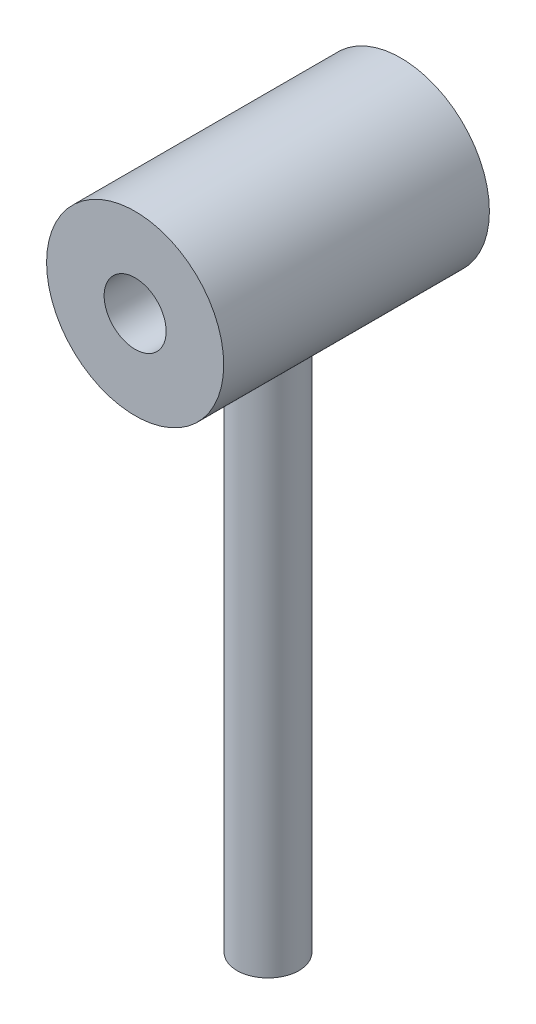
from build123d import *

# Parameters (mm, degrees)
ESQUISSE2_R             = 3.5
EXTRUSION3_DEPTH        = 70
EXTRUSION4_DEPTH        = 15
EXTRUSION4_DEPTH_BACK   = 15
ESQUISSE3_R             = 10
ESQUISSE4_R             = 3.5
ENL_V_MAT_EXTRU_1_DEPTH = 40


with BuildPart() as part:
    # Esquisse2 → Extrusion3 (new body)
    with BuildSketch(Plane(origin=(0, 0, 0), x_dir=(1, 0, 0), z_dir=(0, 1, 0))):
        with Locations(Location((0, 0, 0), (0, 0, 270))):
            Circle(ESQUISSE2_R)
    extrude(amount=EXTRUSION3_DEPTH)

    # Esquisse3 → Extrusion4 (add, two sides: drawn at the far end of the back side and taken through both)
    with BuildSketch(Plane.XY.offset(-EXTRUSION4_DEPTH_BACK)):
        with Locations((0, 70)):
            Circle(ESQUISSE3_R)
    extrude(amount=EXTRUSION4_DEPTH + EXTRUSION4_DEPTH_BACK)

    # Esquisse4 → Enl_v. mat.-Extru.1 (cut)
    with BuildSketch(Plane.XY.offset(15)):
        with Locations((0, 70)):
            Circle(ESQUISSE4_R)
    extrude(amount=-ENL_V_MAT_EXTRU_1_DEPTH, mode=Mode.SUBTRACT)


solid = part.part
